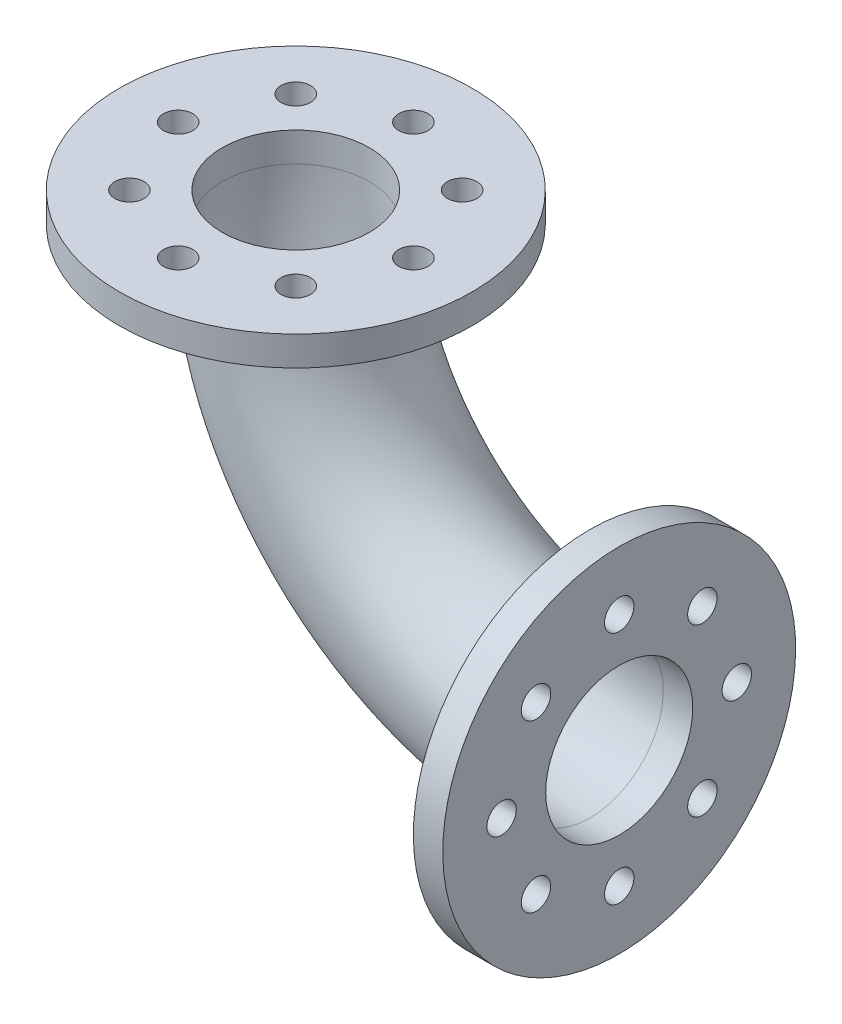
ISO-10303-21;
HEADER;
FILE_DESCRIPTION(('STEP AP214'),'2;1');
FILE_NAME('part.step','',(''),(''),'','','');
FILE_SCHEMA(('AUTOMOTIVE_DESIGN { 1 0 10303 214 1 1 1 1 }'));
ENDSEC;
DATA;
#1=APPLICATION_CONTEXT('core data for automotive mechanical design processes');
#2=APPLICATION_PROTOCOL_DEFINITION('international standard','automotive_design',2000,#1);
#3=PRODUCT_CONTEXT('',#1,'mechanical');
#4=PRODUCT('Part','Part','',(#3));
#5=PRODUCT_RELATED_PRODUCT_CATEGORY('part','',(#4));
#6=PRODUCT_DEFINITION_FORMATION('','',#4);
#7=PRODUCT_DEFINITION_CONTEXT('part definition',#1,'design');
#8=PRODUCT_DEFINITION('design','',#6,#7);
#9=PRODUCT_DEFINITION_SHAPE('','',#8);
#10=(LENGTH_UNIT() NAMED_UNIT(*) SI_UNIT(.MILLI.,.METRE.));
#11=(NAMED_UNIT(*) PLANE_ANGLE_UNIT() SI_UNIT($,.RADIAN.));
#12=(NAMED_UNIT(*) SI_UNIT($,.STERADIAN.) SOLID_ANGLE_UNIT());
#13=UNCERTAINTY_MEASURE_WITH_UNIT(LENGTH_MEASURE(1.E-05),#10,'distance_accuracy_value','');
#14=(GEOMETRIC_REPRESENTATION_CONTEXT(3) GLOBAL_UNCERTAINTY_ASSIGNED_CONTEXT((#13)) GLOBAL_UNIT_ASSIGNED_CONTEXT((#10,
#11,#12)) REPRESENTATION_CONTEXT('',''));
#15=CARTESIAN_POINT('',(0.,0.,0.));
#16=DIRECTION('',(0.,0.,1.));
#17=DIRECTION('',(1.,0.,0.));
#18=AXIS2_PLACEMENT_3D('',#15,#16,#17);
#19=CARTESIAN_POINT('',(0.,0.,0.));
#20=DIRECTION('',(0.,0.,-1.));
#21=DIRECTION('',(-1.,0.,0.));
#22=AXIS2_PLACEMENT_3D('',#19,#20,#21);
#23=TOROIDAL_SURFACE('',#22,50.,12.5);
#24=CARTESIAN_POINT('',(1.74574168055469E-13,-50.,0.));
#25=DIRECTION('',(-1.,0.,0.));
#26=DIRECTION('',(0.,0.,1.));
#27=AXIS2_PLACEMENT_3D('',#24,#25,#26);
#28=CIRCLE('',#27,12.5);
#29=CARTESIAN_POINT('',(2.18217710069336E-13,-62.5,0.));
#30=VERTEX_POINT('',#29);
#31=EDGE_CURVE('E10',#30,#30,#28,.T.);
#32=CARTESIAN_POINT('',(-50.,0.,0.));
#33=DIRECTION('',(0.,1.,0.));
#34=DIRECTION('',(0.,0.,1.));
#35=AXIS2_PLACEMENT_3D('',#32,#33,#34);
#36=CIRCLE('',#35,12.5);
#37=CARTESIAN_POINT('',(-62.5,0.,0.));
#38=VERTEX_POINT('',#37);
#39=EDGE_CURVE('E41',#38,#38,#36,.T.);
#40=CARTESIAN_POINT('',(0.,0.,0.));
#41=DIRECTION('',(0.,0.,-1.));
#42=DIRECTION('',(-1.,0.,0.));
#43=AXIS2_PLACEMENT_3D('',#40,#41,#42);
#44=CIRCLE('',#43,62.5);
#45=EDGE_CURVE('',#30,#38,#44,.T.);
#46=ORIENTED_EDGE('',*,*,#31,.F.);
#47=ORIENTED_EDGE('',*,*,#39,.T.);
#48=ORIENTED_EDGE('',*,*,#45,.T.);
#49=ORIENTED_EDGE('',*,*,#45,.F.);
#50=EDGE_LOOP('',(#46,#48,#47,#49));
#51=FACE_BOUND('',#50,.T.);
#52=ADVANCED_FACE('F30',(#51),#23,.F.);
#53=CARTESIAN_POINT('',(0.,0.,0.));
#54=DIRECTION('',(0.,0.,-1.));
#55=DIRECTION('',(-1.,0.,0.));
#56=AXIS2_PLACEMENT_3D('',#53,#54,#55);
#57=TOROIDAL_SURFACE('',#56,50.,15.);
#58=CARTESIAN_POINT('',(1.74574168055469E-13,-50.,0.));
#59=DIRECTION('',(1.,0.,0.));
#60=DIRECTION('',(0.,1.,0.));
#61=AXIS2_PLACEMENT_3D('',#58,#59,#60);
#62=CIRCLE('',#61,15.);
#63=CARTESIAN_POINT('',(2.2694641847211E-13,-65.,0.));
#64=VERTEX_POINT('',#63);
#65=EDGE_CURVE('E56',#64,#64,#62,.F.);
#66=CARTESIAN_POINT('',(-50.,0.,0.));
#67=DIRECTION('',(0.,1.,0.));
#68=DIRECTION('',(0.,0.,1.));
#69=AXIS2_PLACEMENT_3D('',#66,#67,#68);
#70=CIRCLE('',#69,15.);
#71=CARTESIAN_POINT('',(-65.,0.,0.));
#72=VERTEX_POINT('',#71);
#73=EDGE_CURVE('E37',#72,#72,#70,.T.);
#74=CARTESIAN_POINT('',(0.,0.,0.));
#75=DIRECTION('',(0.,0.,-1.));
#76=DIRECTION('',(-1.,0.,0.));
#77=AXIS2_PLACEMENT_3D('',#74,#75,#76);
#78=CIRCLE('',#77,65.);
#79=EDGE_CURVE('',#64,#72,#78,.T.);
#80=ORIENTED_EDGE('',*,*,#65,.T.);
#81=ORIENTED_EDGE('',*,*,#73,.F.);
#82=ORIENTED_EDGE('',*,*,#79,.T.);
#83=ORIENTED_EDGE('',*,*,#79,.F.);
#84=EDGE_LOOP('',(#80,#82,#81,#83));
#85=FACE_BOUND('',#84,.T.);
#86=ADVANCED_FACE('F32',(#85),#57,.T.);
#87=CARTESIAN_POINT('',(-50.,5.,0.));
#88=DIRECTION('',(0.,1.,0.));
#89=DIRECTION('',(0.,0.,1.));
#90=AXIS2_PLACEMENT_3D('',#87,#88,#89);
#91=PLANE('',#90);
#92=CARTESIAN_POINT('',(-64.1421356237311,5.,14.1421356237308));
#93=DIRECTION('',(0.,1.,0.));
#94=DIRECTION('',(0.707106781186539,0.,0.707106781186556));
#95=AXIS2_PLACEMENT_3D('',#92,#93,#94);
#96=CIRCLE('',#95,2.5);
#97=CARTESIAN_POINT('',(-62.3743686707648,5.,15.9099025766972));
#98=VERTEX_POINT('',#97);
#99=EDGE_CURVE('E113',#98,#98,#96,.T.);
#100=ORIENTED_EDGE('',*,*,#99,.F.);
#101=EDGE_LOOP('',(#100));
#102=FACE_BOUND('',#101,.T.);
#103=CARTESIAN_POINT('',(-50.0000000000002,5.,20.));
#104=DIRECTION('',(0.,1.,0.));
#105=DIRECTION('',(1.,0.,0.));
#106=AXIS2_PLACEMENT_3D('',#103,#104,#105);
#107=CIRCLE('',#106,2.5);
#108=CARTESIAN_POINT('',(-47.5000000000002,5.,20.));
#109=VERTEX_POINT('',#108);
#110=EDGE_CURVE('E107',#109,#109,#107,.T.);
#111=ORIENTED_EDGE('',*,*,#110,.F.);
#112=EDGE_LOOP('',(#111));
#113=FACE_BOUND('',#112,.T.);
#114=CARTESIAN_POINT('',(-35.8578643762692,5.,14.1421356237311));
#115=DIRECTION('',(0.,1.,0.));
#116=DIRECTION('',(0.707106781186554,0.,-0.707106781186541));
#117=AXIS2_PLACEMENT_3D('',#114,#115,#116);
#118=CIRCLE('',#117,2.5);
#119=CARTESIAN_POINT('',(-34.0900974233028,5.,12.3743686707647));
#120=VERTEX_POINT('',#119);
#121=EDGE_CURVE('E99',#120,#120,#118,.T.);
#122=ORIENTED_EDGE('',*,*,#121,.F.);
#123=EDGE_LOOP('',(#122));
#124=FACE_BOUND('',#123,.T.);
#125=CARTESIAN_POINT('',(-30.,5.,1.39659334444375E-13));
#126=DIRECTION('',(0.,1.,0.));
#127=DIRECTION('',(0.,0.,-1.));
#128=AXIS2_PLACEMENT_3D('',#125,#126,#127);
#129=CIRCLE('',#128,2.5);
#130=CARTESIAN_POINT('',(-30.,5.,-2.49999999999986));
#131=VERTEX_POINT('',#130);
#132=EDGE_CURVE('E90',#131,#131,#129,.T.);
#133=ORIENTED_EDGE('',*,*,#132,.F.);
#134=EDGE_LOOP('',(#133));
#135=FACE_BOUND('',#134,.T.);
#136=CARTESIAN_POINT('',(-35.857864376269,5.,-14.1421356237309));
#137=DIRECTION('',(0.,1.,0.));
#138=DIRECTION('',(-0.707106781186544,0.,-0.707106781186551));
#139=AXIS2_PLACEMENT_3D('',#136,#137,#138);
#140=CIRCLE('',#139,2.5);
#141=CARTESIAN_POINT('',(-37.6256313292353,5.,-15.9099025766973));
#142=VERTEX_POINT('',#141);
#143=EDGE_CURVE('E87',#142,#142,#140,.T.);
#144=ORIENTED_EDGE('',*,*,#143,.F.);
#145=EDGE_LOOP('',(#144));
#146=FACE_BOUND('',#145,.T.);
#147=CARTESIAN_POINT('',(-49.9999999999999,5.,-20.));
#148=DIRECTION('',(0.,1.,0.));
#149=DIRECTION('',(-1.,0.,0.));
#150=AXIS2_PLACEMENT_3D('',#147,#148,#149);
#151=CIRCLE('',#150,2.5);
#152=CARTESIAN_POINT('',(-52.4999999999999,5.,-20.));
#153=VERTEX_POINT('',#152);
#154=EDGE_CURVE('E83',#153,#153,#151,.T.);
#155=ORIENTED_EDGE('',*,*,#154,.F.);
#156=EDGE_LOOP('',(#155));
#157=FACE_BOUND('',#156,.T.);
#158=CARTESIAN_POINT('',(-64.1421356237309,5.,-14.142135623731));
#159=DIRECTION('',(0.,1.,0.));
#160=DIRECTION('',(-0.707106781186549,0.,0.707106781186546));
#161=AXIS2_PLACEMENT_3D('',#158,#159,#160);
#162=CIRCLE('',#161,2.5);
#163=CARTESIAN_POINT('',(-65.9099025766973,5.,-12.3743686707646));
#164=VERTEX_POINT('',#163);
#165=EDGE_CURVE('E77',#164,#164,#162,.T.);
#166=ORIENTED_EDGE('',*,*,#165,.F.);
#167=EDGE_LOOP('',(#166));
#168=FACE_BOUND('',#167,.T.);
#169=CARTESIAN_POINT('',(-70.,5.,0.));
#170=DIRECTION('',(0.,1.,0.));
#171=DIRECTION('',(0.,0.,1.));
#172=AXIS2_PLACEMENT_3D('',#169,#170,#171);
#173=CIRCLE('',#172,2.5);
#174=CARTESIAN_POINT('',(-70.,5.,2.5));
#175=VERTEX_POINT('',#174);
#176=EDGE_CURVE('E71',#175,#175,#173,.T.);
#177=ORIENTED_EDGE('',*,*,#176,.F.);
#178=EDGE_LOOP('',(#177));
#179=FACE_BOUND('',#178,.T.);
#180=CARTESIAN_POINT('',(-50.,5.,0.));
#181=DIRECTION('',(0.,1.,0.));
#182=DIRECTION('',(0.,0.,1.));
#183=AXIS2_PLACEMENT_3D('',#180,#181,#182);
#184=CIRCLE('',#183,30.);
#185=CARTESIAN_POINT('',(-50.,5.,30.));
#186=VERTEX_POINT('',#185);
#187=EDGE_CURVE('E45',#186,#186,#184,.T.);
#188=ORIENTED_EDGE('',*,*,#187,.T.);
#189=EDGE_LOOP('',(#188));
#190=FACE_BOUND('',#189,.T.);
#191=CARTESIAN_POINT('',(-50.,5.,0.));
#192=DIRECTION('',(0.,1.,0.));
#193=DIRECTION('',(0.,0.,1.));
#194=AXIS2_PLACEMENT_3D('',#191,#192,#193);
#195=CIRCLE('',#194,12.5);
#196=CARTESIAN_POINT('',(-50.,5.,12.5));
#197=VERTEX_POINT('',#196);
#198=EDGE_CURVE('E53',#197,#197,#195,.T.);
#199=ORIENTED_EDGE('',*,*,#198,.F.);
#200=EDGE_LOOP('',(#199));
#201=FACE_BOUND('',#200,.T.);
#202=ADVANCED_FACE('F209',(#102,#113,#124,#135,#146,#157,#168,#179,#190,#201),#91,.T.);
#203=CARTESIAN_POINT('',(-50.,0.,0.));
#204=DIRECTION('',(0.,1.,0.));
#205=DIRECTION('',(0.,0.,1.));
#206=AXIS2_PLACEMENT_3D('',#203,#204,#205);
#207=PLANE('',#206);
#208=CARTESIAN_POINT('',(-64.1421356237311,0.,14.1421356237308));
#209=DIRECTION('',(0.,1.,0.));
#210=DIRECTION('',(0.,0.,1.));
#211=AXIS2_PLACEMENT_3D('',#208,#209,#210);
#212=CIRCLE('',#211,2.5);
#213=CARTESIAN_POINT('',(-64.1421356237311,0.,16.6421356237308));
#214=VERTEX_POINT('',#213);
#215=EDGE_CURVE('E110',#214,#214,#212,.F.);
#216=ORIENTED_EDGE('',*,*,#215,.F.);
#217=EDGE_LOOP('',(#216));
#218=FACE_BOUND('',#217,.T.);
#219=CARTESIAN_POINT('',(-50.0000000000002,0.,20.));
#220=DIRECTION('',(0.,1.,0.));
#221=DIRECTION('',(0.,0.,1.));
#222=AXIS2_PLACEMENT_3D('',#219,#220,#221);
#223=CIRCLE('',#222,2.5);
#224=CARTESIAN_POINT('',(-50.0000000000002,0.,22.5));
#225=VERTEX_POINT('',#224);
#226=EDGE_CURVE('E102',#225,#225,#223,.F.);
#227=ORIENTED_EDGE('',*,*,#226,.F.);
#228=EDGE_LOOP('',(#227));
#229=FACE_BOUND('',#228,.T.);
#230=CARTESIAN_POINT('',(-35.8578643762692,0.,14.1421356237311));
#231=DIRECTION('',(0.,1.,0.));
#232=DIRECTION('',(0.,0.,1.));
#233=AXIS2_PLACEMENT_3D('',#230,#231,#232);
#234=CIRCLE('',#233,2.5);
#235=CARTESIAN_POINT('',(-35.8578643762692,0.,16.6421356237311));
#236=VERTEX_POINT('',#235);
#237=EDGE_CURVE('E98',#236,#236,#234,.F.);
#238=ORIENTED_EDGE('',*,*,#237,.F.);
#239=EDGE_LOOP('',(#238));
#240=FACE_BOUND('',#239,.T.);
#241=CARTESIAN_POINT('',(-30.,0.,1.39659334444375E-13));
#242=DIRECTION('',(0.,1.,0.));
#243=DIRECTION('',(0.,0.,1.));
#244=AXIS2_PLACEMENT_3D('',#241,#242,#243);
#245=CIRCLE('',#244,2.5);
#246=CARTESIAN_POINT('',(-30.,0.,2.50000000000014));
#247=VERTEX_POINT('',#246);
#248=EDGE_CURVE('E95',#247,#247,#245,.F.);
#249=ORIENTED_EDGE('',*,*,#248,.F.);
#250=EDGE_LOOP('',(#249));
#251=FACE_BOUND('',#250,.T.);
#252=CARTESIAN_POINT('',(-35.857864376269,0.,-14.1421356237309));
#253=DIRECTION('',(0.,1.,0.));
#254=DIRECTION('',(0.,0.,1.));
#255=AXIS2_PLACEMENT_3D('',#252,#253,#254);
#256=CIRCLE('',#255,2.5);
#257=CARTESIAN_POINT('',(-35.857864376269,0.,-11.6421356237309));
#258=VERTEX_POINT('',#257);
#259=EDGE_CURVE('E86',#258,#258,#256,.F.);
#260=ORIENTED_EDGE('',*,*,#259,.F.);
#261=EDGE_LOOP('',(#260));
#262=FACE_BOUND('',#261,.T.);
#263=CARTESIAN_POINT('',(-49.9999999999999,0.,-20.));
#264=DIRECTION('',(0.,1.,0.));
#265=DIRECTION('',(0.,0.,1.));
#266=AXIS2_PLACEMENT_3D('',#263,#264,#265);
#267=CIRCLE('',#266,2.5);
#268=CARTESIAN_POINT('',(-49.9999999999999,0.,-17.5));
#269=VERTEX_POINT('',#268);
#270=EDGE_CURVE('E80',#269,#269,#267,.F.);
#271=ORIENTED_EDGE('',*,*,#270,.F.);
#272=EDGE_LOOP('',(#271));
#273=FACE_BOUND('',#272,.T.);
#274=CARTESIAN_POINT('',(-64.1421356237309,0.,-14.142135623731));
#275=DIRECTION('',(0.,1.,0.));
#276=DIRECTION('',(0.,0.,1.));
#277=AXIS2_PLACEMENT_3D('',#274,#275,#276);
#278=CIRCLE('',#277,2.5);
#279=CARTESIAN_POINT('',(-64.1421356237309,0.,-11.642135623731));
#280=VERTEX_POINT('',#279);
#281=EDGE_CURVE('E74',#280,#280,#278,.F.);
#282=ORIENTED_EDGE('',*,*,#281,.F.);
#283=EDGE_LOOP('',(#282));
#284=FACE_BOUND('',#283,.T.);
#285=CARTESIAN_POINT('',(-70.,0.,0.));
#286=DIRECTION('',(0.,1.,0.));
#287=DIRECTION('',(0.,0.,1.));
#288=AXIS2_PLACEMENT_3D('',#285,#286,#287);
#289=CIRCLE('',#288,2.5);
#290=CARTESIAN_POINT('',(-70.,0.,2.5));
#291=VERTEX_POINT('',#290);
#292=EDGE_CURVE('E68',#291,#291,#289,.F.);
#293=ORIENTED_EDGE('',*,*,#292,.F.);
#294=EDGE_LOOP('',(#293));
#295=FACE_BOUND('',#294,.T.);
#296=ORIENTED_EDGE('',*,*,#73,.T.);
#297=EDGE_LOOP('',(#296));
#298=FACE_BOUND('',#297,.T.);
#299=CARTESIAN_POINT('',(-50.,0.,0.));
#300=DIRECTION('',(0.,1.,0.));
#301=DIRECTION('',(0.,0.,1.));
#302=AXIS2_PLACEMENT_3D('',#299,#300,#301);
#303=CIRCLE('',#302,30.);
#304=CARTESIAN_POINT('',(-50.,0.,30.));
#305=VERTEX_POINT('',#304);
#306=EDGE_CURVE('E50',#305,#305,#303,.T.);
#307=ORIENTED_EDGE('',*,*,#306,.F.);
#308=EDGE_LOOP('',(#307));
#309=FACE_BOUND('',#308,.T.);
#310=ADVANCED_FACE('F217',(#218,#229,#240,#251,#262,#273,#284,#295,#298,#309),#207,.F.);
#311=CARTESIAN_POINT('',(-50.,5.,0.));
#312=DIRECTION('',(0.,-1.,0.));
#313=DIRECTION('',(0.,0.,-1.));
#314=AXIS2_PLACEMENT_3D('',#311,#312,#313);
#315=CYLINDRICAL_SURFACE('',#314,30.);
#316=ORIENTED_EDGE('',*,*,#187,.F.);
#317=EDGE_LOOP('',(#316));
#318=FACE_BOUND('',#317,.T.);
#319=ORIENTED_EDGE('',*,*,#306,.T.);
#320=EDGE_LOOP('',(#319));
#321=FACE_BOUND('',#320,.T.);
#322=ADVANCED_FACE('F213',(#318,#321),#315,.T.);
#323=CARTESIAN_POINT('',(-50.,5.,0.));
#324=DIRECTION('',(0.,-1.,0.));
#325=DIRECTION('',(0.,0.,-1.));
#326=AXIS2_PLACEMENT_3D('',#323,#324,#325);
#327=CYLINDRICAL_SURFACE('',#326,12.5);
#328=ORIENTED_EDGE('',*,*,#198,.T.);
#329=EDGE_LOOP('',(#328));
#330=FACE_BOUND('',#329,.T.);
#331=ORIENTED_EDGE('',*,*,#39,.F.);
#332=EDGE_LOOP('',(#331));
#333=FACE_BOUND('',#332,.T.);
#334=ADVANCED_FACE('F216',(#330,#333),#327,.F.);
#335=CARTESIAN_POINT('',(4.99999999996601,-50.0000000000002,0.));
#336=DIRECTION('',(1.,0.,0.));
#337=DIRECTION('',(0.,1.,0.));
#338=AXIS2_PLACEMENT_3D('',#335,#336,#337);
#339=PLANE('',#338);
#340=CARTESIAN_POINT('',(4.99999999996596,-35.857864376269,14.1421356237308));
#341=DIRECTION('',(1.,0.,0.));
#342=DIRECTION('',(0.,1.,0.));
#343=AXIS2_PLACEMENT_3D('',#340,#341,#342);
#344=CIRCLE('',#343,2.5);
#345=CARTESIAN_POINT('',(4.99999999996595,-33.357864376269,14.1421356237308));
#346=VERTEX_POINT('',#345);
#347=EDGE_CURVE('E159',#346,#346,#344,.F.);
#348=ORIENTED_EDGE('',*,*,#347,.T.);
#349=EDGE_LOOP('',(#348));
#350=FACE_BOUND('',#349,.T.);
#351=CARTESIAN_POINT('',(4.99999999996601,-50.,20.));
#352=DIRECTION('',(1.,0.,0.));
#353=DIRECTION('',(0.,1.,0.));
#354=AXIS2_PLACEMENT_3D('',#351,#352,#353);
#355=CIRCLE('',#354,2.5);
#356=CARTESIAN_POINT('',(4.999999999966,-47.5,20.));
#357=VERTEX_POINT('',#356);
#358=EDGE_CURVE('E153',#357,#357,#355,.F.);
#359=ORIENTED_EDGE('',*,*,#358,.T.);
#360=EDGE_LOOP('',(#359));
#361=FACE_BOUND('',#360,.T.);
#362=CARTESIAN_POINT('',(4.99999999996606,-64.142135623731,14.1421356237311));
#363=DIRECTION('',(1.,0.,0.));
#364=DIRECTION('',(0.,1.,0.));
#365=AXIS2_PLACEMENT_3D('',#362,#363,#364);
#366=CIRCLE('',#365,2.5);
#367=CARTESIAN_POINT('',(4.99999999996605,-61.642135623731,14.1421356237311));
#368=VERTEX_POINT('',#367);
#369=EDGE_CURVE('E147',#368,#368,#366,.F.);
#370=ORIENTED_EDGE('',*,*,#369,.T.);
#371=EDGE_LOOP('',(#370));
#372=FACE_BOUND('',#371,.T.);
#373=CARTESIAN_POINT('',(4.99999999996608,-70.0000000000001,1.39659334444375E-13));
#374=DIRECTION('',(1.,0.,0.));
#375=DIRECTION('',(0.,1.,0.));
#376=AXIS2_PLACEMENT_3D('',#373,#374,#375);
#377=CIRCLE('',#376,2.5);
#378=CARTESIAN_POINT('',(4.99999999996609,-72.5000000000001,1.39659334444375E-13));
#379=VERTEX_POINT('',#378);
#380=EDGE_CURVE('E141',#379,#379,#377,.F.);
#381=ORIENTED_EDGE('',*,*,#380,.T.);
#382=EDGE_LOOP('',(#381));
#383=FACE_BOUND('',#382,.T.);
#384=CARTESIAN_POINT('',(4.99999999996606,-64.1421356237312,-14.1421356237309));
#385=DIRECTION('',(1.,0.,0.));
#386=DIRECTION('',(0.,1.,0.));
#387=AXIS2_PLACEMENT_3D('',#384,#385,#386);
#388=CIRCLE('',#387,2.5);
#389=CARTESIAN_POINT('',(4.99999999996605,-61.6421356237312,-14.1421356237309));
#390=VERTEX_POINT('',#389);
#391=EDGE_CURVE('E135',#390,#390,#388,.F.);
#392=ORIENTED_EDGE('',*,*,#391,.T.);
#393=EDGE_LOOP('',(#392));
#394=FACE_BOUND('',#393,.T.);
#395=CARTESIAN_POINT('',(4.99999999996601,-50.0000000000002,-20.));
#396=DIRECTION('',(1.,0.,0.));
#397=DIRECTION('',(0.,1.,0.));
#398=AXIS2_PLACEMENT_3D('',#395,#396,#397);
#399=CIRCLE('',#398,2.5);
#400=CARTESIAN_POINT('',(4.999999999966,-47.5000000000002,-20.));
#401=VERTEX_POINT('',#400);
#402=EDGE_CURVE('E129',#401,#401,#399,.F.);
#403=ORIENTED_EDGE('',*,*,#402,.T.);
#404=EDGE_LOOP('',(#403));
#405=FACE_BOUND('',#404,.T.);
#406=CARTESIAN_POINT('',(4.99999999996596,-35.8578643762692,-14.142135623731));
#407=DIRECTION('',(1.,0.,0.));
#408=DIRECTION('',(0.,1.,0.));
#409=AXIS2_PLACEMENT_3D('',#406,#407,#408);
#410=CIRCLE('',#409,2.5);
#411=CARTESIAN_POINT('',(4.99999999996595,-33.3578643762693,-14.142135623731));
#412=VERTEX_POINT('',#411);
#413=EDGE_CURVE('E123',#412,#412,#410,.F.);
#414=ORIENTED_EDGE('',*,*,#413,.T.);
#415=EDGE_LOOP('',(#414));
#416=FACE_BOUND('',#415,.T.);
#417=CARTESIAN_POINT('',(4.99999999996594,-30.0000000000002,0.));
#418=DIRECTION('',(1.,0.,0.));
#419=DIRECTION('',(0.,1.,0.));
#420=AXIS2_PLACEMENT_3D('',#417,#418,#419);
#421=CIRCLE('',#420,2.5);
#422=CARTESIAN_POINT('',(4.99999999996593,-27.5000000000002,0.));
#423=VERTEX_POINT('',#422);
#424=EDGE_CURVE('E117',#423,#423,#421,.F.);
#425=ORIENTED_EDGE('',*,*,#424,.T.);
#426=EDGE_LOOP('',(#425));
#427=FACE_BOUND('',#426,.T.);
#428=CARTESIAN_POINT('',(4.99999999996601,-50.0000000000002,0.));
#429=DIRECTION('',(1.,0.,0.));
#430=DIRECTION('',(0.,1.,0.));
#431=AXIS2_PLACEMENT_3D('',#428,#429,#430);
#432=CIRCLE('',#431,30.);
#433=CARTESIAN_POINT('',(4.9999999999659,-20.0000000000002,0.));
#434=VERTEX_POINT('',#433);
#435=EDGE_CURVE('E59',#434,#434,#432,.T.);
#436=ORIENTED_EDGE('',*,*,#435,.T.);
#437=EDGE_LOOP('',(#436));
#438=FACE_BOUND('',#437,.T.);
#439=CARTESIAN_POINT('',(4.99999999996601,-50.0000000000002,0.));
#440=DIRECTION('',(1.,0.,0.));
#441=DIRECTION('',(0.,1.,0.));
#442=AXIS2_PLACEMENT_3D('',#439,#440,#441);
#443=CIRCLE('',#442,12.5);
#444=CARTESIAN_POINT('',(4.99999999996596,-37.5000000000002,0.));
#445=VERTEX_POINT('',#444);
#446=EDGE_CURVE('E65',#445,#445,#443,.T.);
#447=ORIENTED_EDGE('',*,*,#446,.F.);
#448=EDGE_LOOP('',(#447));
#449=FACE_BOUND('',#448,.T.);
#450=ADVANCED_FACE('F171',(#350,#361,#372,#383,#394,#405,#416,#427,#438,#449),#339,.T.);
#451=CARTESIAN_POINT('',(-3.39925394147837E-11,-50.0000000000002,0.));
#452=DIRECTION('',(1.,0.,0.));
#453=DIRECTION('',(0.,1.,0.));
#454=AXIS2_PLACEMENT_3D('',#451,#452,#453);
#455=PLANE('',#454);
#456=CARTESIAN_POINT('',(1.70784034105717E-10,-35.8578643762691,14.1421356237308));
#457=DIRECTION('',(-1.,0.,0.));
#458=DIRECTION('',(0.,-0.707106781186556,-0.707106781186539));
#459=AXIS2_PLACEMENT_3D('',#456,#457,#458);
#460=CIRCLE('',#459,2.5);
#461=CARTESIAN_POINT('',(1.70789714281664E-10,-37.6256313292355,12.3743686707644));
#462=VERTEX_POINT('',#461);
#463=EDGE_CURVE('E156',#462,#462,#460,.T.);
#464=ORIENTED_EDGE('',*,*,#463,.F.);
#465=EDGE_LOOP('',(#464));
#466=FACE_BOUND('',#465,.T.);
#467=CARTESIAN_POINT('',(1.70843167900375E-10,-50.,20.));
#468=DIRECTION('',(-1.,0.,0.));
#469=DIRECTION('',(0.,0.,-1.));
#470=AXIS2_PLACEMENT_3D('',#467,#468,#469);
#471=CIRCLE('',#470,2.5);
#472=CARTESIAN_POINT('',(1.70841488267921E-10,-50.,17.5));
#473=VERTEX_POINT('',#472);
#474=EDGE_CURVE('E150',#473,#473,#471,.T.);
#475=ORIENTED_EDGE('',*,*,#474,.F.);
#476=EDGE_LOOP('',(#475));
#477=FACE_BOUND('',#476,.T.);
#478=CARTESIAN_POINT('',(1.70902301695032E-10,-64.142135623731,14.1421356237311));
#479=DIRECTION('',(-1.,0.,0.));
#480=DIRECTION('',(0.,0.707106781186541,-0.707106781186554));
#481=AXIS2_PLACEMENT_3D('',#478,#479,#480);
#482=CIRCLE('',#481,2.5);
#483=CARTESIAN_POINT('',(1.70893262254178E-10,-62.3743686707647,12.3743686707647));
#484=VERTEX_POINT('',#483);
#485=EDGE_CURVE('E144',#484,#484,#482,.T.);
#486=ORIENTED_EDGE('',*,*,#485,.F.);
#487=EDGE_LOOP('',(#486));
#488=FACE_BOUND('',#487,.T.);
#489=CARTESIAN_POINT('',(1.70926434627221E-10,-70.0000000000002,1.39659334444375E-13));
#490=DIRECTION('',(-1.,0.,0.));
#491=DIRECTION('',(0.,1.,0.));
#492=AXIS2_PLACEMENT_3D('',#489,#490,#491);
#493=CIRCLE('',#492,2.5);
#494=CARTESIAN_POINT('',(1.70937916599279E-10,-72.5000000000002,1.39659334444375E-13));
#495=VERTEX_POINT('',#494);
#496=EDGE_CURVE('E138',#495,#495,#493,.T.);
#497=ORIENTED_EDGE('',*,*,#496,.F.);
#498=EDGE_LOOP('',(#497));
#499=FACE_BOUND('',#498,.T.);
#500=CARTESIAN_POINT('',(1.70902301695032E-10,-64.1421356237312,-14.1421356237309));
#501=DIRECTION('',(-1.,0.,0.));
#502=DIRECTION('',(0.,0.707106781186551,0.707106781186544));
#503=AXIS2_PLACEMENT_3D('',#500,#501,#502);
#504=CIRCLE('',#503,2.5);
#505=CARTESIAN_POINT('',(1.70893262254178E-10,-62.3743686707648,-12.3743686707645));
#506=VERTEX_POINT('',#505);
#507=EDGE_CURVE('E132',#506,#506,#504,.T.);
#508=ORIENTED_EDGE('',*,*,#507,.F.);
#509=EDGE_LOOP('',(#508));
#510=FACE_BOUND('',#509,.T.);
#511=CARTESIAN_POINT('',(1.70843167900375E-10,-50.0000000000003,-20.));
#512=DIRECTION('',(-1.,0.,0.));
#513=DIRECTION('',(0.,0.,1.));
#514=AXIS2_PLACEMENT_3D('',#511,#512,#513);
#515=CIRCLE('',#514,2.5);
#516=CARTESIAN_POINT('',(1.70841488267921E-10,-50.0000000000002,-17.5));
#517=VERTEX_POINT('',#516);
#518=EDGE_CURVE('E126',#517,#517,#515,.T.);
#519=ORIENTED_EDGE('',*,*,#518,.F.);
#520=EDGE_LOOP('',(#519));
#521=FACE_BOUND('',#520,.T.);
#522=CARTESIAN_POINT('',(1.70784034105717E-10,-35.8578643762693,-14.142135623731));
#523=DIRECTION('',(-1.,0.,0.));
#524=DIRECTION('',(0.,-0.707106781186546,0.707106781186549));
#525=AXIS2_PLACEMENT_3D('',#522,#523,#524);
#526=CIRCLE('',#525,2.5);
#527=CARTESIAN_POINT('',(1.70789714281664E-10,-37.6256313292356,-12.3743686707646));
#528=VERTEX_POINT('',#527);
#529=EDGE_CURVE('E120',#528,#528,#526,.T.);
#530=ORIENTED_EDGE('',*,*,#529,.F.);
#531=EDGE_LOOP('',(#530));
#532=FACE_BOUND('',#531,.T.);
#533=CARTESIAN_POINT('',(1.70759901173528E-10,-30.0000000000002,0.));
#534=DIRECTION('',(-1.,0.,0.));
#535=DIRECTION('',(0.,-1.,0.));
#536=AXIS2_PLACEMENT_3D('',#533,#534,#535);
#537=CIRCLE('',#536,2.5);
#538=CARTESIAN_POINT('',(1.7076862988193E-10,-32.5000000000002,0.));
#539=VERTEX_POINT('',#538);
#540=EDGE_CURVE('E116',#539,#539,#537,.T.);
#541=ORIENTED_EDGE('',*,*,#540,.F.);
#542=EDGE_LOOP('',(#541));
#543=FACE_BOUND('',#542,.T.);
#544=ORIENTED_EDGE('',*,*,#65,.F.);
#545=EDGE_LOOP('',(#544));
#546=FACE_BOUND('',#545,.T.);
#547=CARTESIAN_POINT('',(-3.39925394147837E-11,-50.0000000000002,0.));
#548=DIRECTION('',(1.,0.,0.));
#549=DIRECTION('',(0.,1.,0.));
#550=AXIS2_PLACEMENT_3D('',#547,#548,#549);
#551=CIRCLE('',#550,30.);
#552=CARTESIAN_POINT('',(-3.4097283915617E-11,-20.0000000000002,0.));
#553=VERTEX_POINT('',#552);
#554=EDGE_CURVE('E62',#553,#553,#551,.T.);
#555=ORIENTED_EDGE('',*,*,#554,.F.);
#556=EDGE_LOOP('',(#555));
#557=FACE_BOUND('',#556,.T.);
#558=ADVANCED_FACE('F167',(#466,#477,#488,#499,#510,#521,#532,#543,#546,#557),#455,.F.);
#559=CARTESIAN_POINT('',(4.99999999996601,-50.0000000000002,0.));
#560=DIRECTION('',(-1.,0.,0.));
#561=DIRECTION('',(0.,-1.,0.));
#562=AXIS2_PLACEMENT_3D('',#559,#560,#561);
#563=CYLINDRICAL_SURFACE('',#562,30.);
#564=ORIENTED_EDGE('',*,*,#435,.F.);
#565=EDGE_LOOP('',(#564));
#566=FACE_BOUND('',#565,.T.);
#567=ORIENTED_EDGE('',*,*,#554,.T.);
#568=EDGE_LOOP('',(#567));
#569=FACE_BOUND('',#568,.T.);
#570=ADVANCED_FACE('F170',(#566,#569),#563,.T.);
#571=CARTESIAN_POINT('',(4.99999999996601,-50.0000000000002,0.));
#572=DIRECTION('',(-1.,0.,0.));
#573=DIRECTION('',(0.,-1.,0.));
#574=AXIS2_PLACEMENT_3D('',#571,#572,#573);
#575=CYLINDRICAL_SURFACE('',#574,12.5);
#576=ORIENTED_EDGE('',*,*,#446,.T.);
#577=EDGE_LOOP('',(#576));
#578=FACE_BOUND('',#577,.T.);
#579=ORIENTED_EDGE('',*,*,#31,.T.);
#580=EDGE_LOOP('',(#579));
#581=FACE_BOUND('',#580,.T.);
#582=ADVANCED_FACE('F192',(#578,#581),#575,.F.);
#583=CARTESIAN_POINT('',(-70.,-80.0010000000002,0.));
#584=DIRECTION('',(0.,1.,0.));
#585=DIRECTION('',(0.,0.,1.));
#586=AXIS2_PLACEMENT_3D('',#583,#584,#585);
#587=CYLINDRICAL_SURFACE('',#586,2.5);
#588=ORIENTED_EDGE('',*,*,#176,.T.);
#589=EDGE_LOOP('',(#588));
#590=FACE_BOUND('',#589,.T.);
#591=ORIENTED_EDGE('',*,*,#292,.T.);
#592=EDGE_LOOP('',(#591));
#593=FACE_BOUND('',#592,.T.);
#594=ADVANCED_FACE('F198',(#590,#593),#587,.F.);
#595=CARTESIAN_POINT('',(-64.1421356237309,-80.0010000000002,-14.142135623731));
#596=DIRECTION('',(0.,1.,0.));
#597=DIRECTION('',(0.,0.,1.));
#598=AXIS2_PLACEMENT_3D('',#595,#596,#597);
#599=CYLINDRICAL_SURFACE('',#598,2.5);
#600=ORIENTED_EDGE('',*,*,#165,.T.);
#601=EDGE_LOOP('',(#600));
#602=FACE_BOUND('',#601,.T.);
#603=ORIENTED_EDGE('',*,*,#281,.T.);
#604=EDGE_LOOP('',(#603));
#605=FACE_BOUND('',#604,.T.);
#606=ADVANCED_FACE('F240',(#602,#605),#599,.F.);
#607=CARTESIAN_POINT('',(-49.9999999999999,-80.0010000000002,-20.));
#608=DIRECTION('',(0.,1.,0.));
#609=DIRECTION('',(0.,0.,1.));
#610=AXIS2_PLACEMENT_3D('',#607,#608,#609);
#611=CYLINDRICAL_SURFACE('',#610,2.5);
#612=ORIENTED_EDGE('',*,*,#154,.T.);
#613=EDGE_LOOP('',(#612));
#614=FACE_BOUND('',#613,.T.);
#615=ORIENTED_EDGE('',*,*,#270,.T.);
#616=EDGE_LOOP('',(#615));
#617=FACE_BOUND('',#616,.T.);
#618=ADVANCED_FACE('F244',(#614,#617),#611,.F.);
#619=CARTESIAN_POINT('',(-35.857864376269,-80.0010000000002,-14.1421356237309));
#620=DIRECTION('',(0.,1.,0.));
#621=DIRECTION('',(0.,0.,1.));
#622=AXIS2_PLACEMENT_3D('',#619,#620,#621);
#623=CYLINDRICAL_SURFACE('',#622,2.5);
#624=ORIENTED_EDGE('',*,*,#143,.T.);
#625=EDGE_LOOP('',(#624));
#626=FACE_BOUND('',#625,.T.);
#627=ORIENTED_EDGE('',*,*,#259,.T.);
#628=EDGE_LOOP('',(#627));
#629=FACE_BOUND('',#628,.T.);
#630=ADVANCED_FACE('F248',(#626,#629),#623,.F.);
#631=CARTESIAN_POINT('',(-30.,-80.0010000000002,1.39659334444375E-13));
#632=DIRECTION('',(0.,1.,0.));
#633=DIRECTION('',(0.,0.,1.));
#634=AXIS2_PLACEMENT_3D('',#631,#632,#633);
#635=CYLINDRICAL_SURFACE('',#634,2.5);
#636=ORIENTED_EDGE('',*,*,#132,.T.);
#637=EDGE_LOOP('',(#636));
#638=FACE_BOUND('',#637,.T.);
#639=ORIENTED_EDGE('',*,*,#248,.T.);
#640=EDGE_LOOP('',(#639));
#641=FACE_BOUND('',#640,.T.);
#642=ADVANCED_FACE('F252',(#638,#641),#635,.F.);
#643=CARTESIAN_POINT('',(-35.8578643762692,-80.0010000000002,14.1421356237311));
#644=DIRECTION('',(0.,1.,0.));
#645=DIRECTION('',(0.,0.,1.));
#646=AXIS2_PLACEMENT_3D('',#643,#644,#645);
#647=CYLINDRICAL_SURFACE('',#646,2.5);
#648=ORIENTED_EDGE('',*,*,#121,.T.);
#649=EDGE_LOOP('',(#648));
#650=FACE_BOUND('',#649,.T.);
#651=ORIENTED_EDGE('',*,*,#237,.T.);
#652=EDGE_LOOP('',(#651));
#653=FACE_BOUND('',#652,.T.);
#654=ADVANCED_FACE('F256',(#650,#653),#647,.F.);
#655=CARTESIAN_POINT('',(-50.0000000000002,-80.0010000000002,20.));
#656=DIRECTION('',(0.,1.,0.));
#657=DIRECTION('',(0.,0.,1.));
#658=AXIS2_PLACEMENT_3D('',#655,#656,#657);
#659=CYLINDRICAL_SURFACE('',#658,2.5);
#660=ORIENTED_EDGE('',*,*,#110,.T.);
#661=EDGE_LOOP('',(#660));
#662=FACE_BOUND('',#661,.T.);
#663=ORIENTED_EDGE('',*,*,#226,.T.);
#664=EDGE_LOOP('',(#663));
#665=FACE_BOUND('',#664,.T.);
#666=ADVANCED_FACE('F260',(#662,#665),#659,.F.);
#667=CARTESIAN_POINT('',(-64.1421356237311,-80.0010000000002,14.1421356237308));
#668=DIRECTION('',(0.,1.,0.));
#669=DIRECTION('',(0.,0.,1.));
#670=AXIS2_PLACEMENT_3D('',#667,#668,#669);
#671=CYLINDRICAL_SURFACE('',#670,2.5);
#672=ORIENTED_EDGE('',*,*,#99,.T.);
#673=EDGE_LOOP('',(#672));
#674=FACE_BOUND('',#673,.T.);
#675=ORIENTED_EDGE('',*,*,#215,.T.);
#676=EDGE_LOOP('',(#675));
#677=FACE_BOUND('',#676,.T.);
#678=ADVANCED_FACE('F264',(#674,#677),#671,.F.);
#679=CARTESIAN_POINT('',(5.00099999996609,-30.0000000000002,0.));
#680=DIRECTION('',(-1.,0.,0.));
#681=DIRECTION('',(0.,-1.,0.));
#682=AXIS2_PLACEMENT_3D('',#679,#680,#681);
#683=CYLINDRICAL_SURFACE('',#682,2.5);
#684=ORIENTED_EDGE('',*,*,#424,.F.);
#685=EDGE_LOOP('',(#684));
#686=FACE_BOUND('',#685,.T.);
#687=ORIENTED_EDGE('',*,*,#540,.T.);
#688=EDGE_LOOP('',(#687));
#689=FACE_BOUND('',#688,.T.);
#690=ADVANCED_FACE('F268',(#686,#689),#683,.F.);
#691=CARTESIAN_POINT('',(5.00099999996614,-35.8578643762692,-14.142135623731));
#692=DIRECTION('',(-1.,0.,0.));
#693=DIRECTION('',(0.,-1.,0.));
#694=AXIS2_PLACEMENT_3D('',#691,#692,#693);
#695=CYLINDRICAL_SURFACE('',#694,2.5);
#696=ORIENTED_EDGE('',*,*,#413,.F.);
#697=EDGE_LOOP('',(#696));
#698=FACE_BOUND('',#697,.T.);
#699=ORIENTED_EDGE('',*,*,#529,.T.);
#700=EDGE_LOOP('',(#699));
#701=FACE_BOUND('',#700,.T.);
#702=ADVANCED_FACE('F272',(#698,#701),#695,.F.);
#703=CARTESIAN_POINT('',(5.00099999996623,-50.0000000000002,-20.));
#704=DIRECTION('',(-1.,0.,0.));
#705=DIRECTION('',(0.,-1.,0.));
#706=AXIS2_PLACEMENT_3D('',#703,#704,#705);
#707=CYLINDRICAL_SURFACE('',#706,2.5);
#708=ORIENTED_EDGE('',*,*,#402,.F.);
#709=EDGE_LOOP('',(#708));
#710=FACE_BOUND('',#709,.T.);
#711=ORIENTED_EDGE('',*,*,#518,.T.);
#712=EDGE_LOOP('',(#711));
#713=FACE_BOUND('',#712,.T.);
#714=ADVANCED_FACE('F276',(#710,#713),#707,.F.);
#715=CARTESIAN_POINT('',(5.00099999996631,-64.1421356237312,-14.1421356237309));
#716=DIRECTION('',(-1.,0.,0.));
#717=DIRECTION('',(0.,-1.,0.));
#718=AXIS2_PLACEMENT_3D('',#715,#716,#717);
#719=CYLINDRICAL_SURFACE('',#718,2.5);
#720=ORIENTED_EDGE('',*,*,#391,.F.);
#721=EDGE_LOOP('',(#720));
#722=FACE_BOUND('',#721,.T.);
#723=ORIENTED_EDGE('',*,*,#507,.T.);
#724=EDGE_LOOP('',(#723));
#725=FACE_BOUND('',#724,.T.);
#726=ADVANCED_FACE('F280',(#722,#725),#719,.F.);
#727=CARTESIAN_POINT('',(5.00099999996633,-70.0000000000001,1.39659334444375E-13));
#728=DIRECTION('',(-1.,0.,0.));
#729=DIRECTION('',(0.,-1.,0.));
#730=AXIS2_PLACEMENT_3D('',#727,#728,#729);
#731=CYLINDRICAL_SURFACE('',#730,2.5);
#732=CARTESIAN_POINT('',(4.99999999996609,-72.5000000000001,1.39659334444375E-13));
#733=CARTESIAN_POINT('',(4.94791666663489,-72.5000000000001,1.39659334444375E-13));
#734=CARTESIAN_POINT('',(4.89583333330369,-72.5000000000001,1.39659334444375E-13));
#735=CARTESIAN_POINT('',(4.79166666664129,-72.5000000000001,1.39659334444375E-13));
#736=CARTESIAN_POINT('',(4.73958333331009,-72.5000000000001,1.39659334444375E-13));
#737=CARTESIAN_POINT('',(4.63541666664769,-72.5000000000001,1.39659334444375E-13));
#738=CARTESIAN_POINT('',(4.58333333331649,-72.5000000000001,1.39659334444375E-13));
#739=CARTESIAN_POINT('',(4.47916666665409,-72.5000000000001,1.39659334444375E-13));
#740=CARTESIAN_POINT('',(4.42708333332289,-72.5000000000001,1.39659334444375E-13));
#741=CARTESIAN_POINT('',(4.32291666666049,-72.5000000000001,1.39659334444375E-13));
#742=CARTESIAN_POINT('',(4.27083333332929,-72.5000000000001,1.39659334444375E-13));
#743=CARTESIAN_POINT('',(4.1666666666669,-72.5000000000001,1.39659334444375E-13));
#744=CARTESIAN_POINT('',(4.1145833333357,-72.5000000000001,1.39659334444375E-13));
#745=CARTESIAN_POINT('',(4.0104166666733,-72.5000000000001,1.39659334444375E-13));
#746=CARTESIAN_POINT('',(3.9583333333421,-72.5000000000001,1.39659334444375E-13));
#747=CARTESIAN_POINT('',(3.8541666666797,-72.5000000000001,1.39659334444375E-13));
#748=CARTESIAN_POINT('',(3.8020833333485,-72.5000000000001,1.39659334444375E-13));
#749=CARTESIAN_POINT('',(3.6979166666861,-72.5000000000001,1.39659334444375E-13));
#750=CARTESIAN_POINT('',(3.6458333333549,-72.5000000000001,1.39659334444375E-13));
#751=CARTESIAN_POINT('',(3.5416666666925,-72.5000000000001,1.39659334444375E-13));
#752=CARTESIAN_POINT('',(3.4895833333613,-72.5000000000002,1.39659334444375E-13));
#753=CARTESIAN_POINT('',(3.3854166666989,-72.5000000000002,1.39659334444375E-13));
#754=CARTESIAN_POINT('',(3.3333333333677,-72.5000000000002,1.39659334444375E-13));
#755=CARTESIAN_POINT('',(3.2291666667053,-72.5000000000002,1.39659334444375E-13));
#756=CARTESIAN_POINT('',(3.17708333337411,-72.5000000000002,1.39659334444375E-13));
#757=CARTESIAN_POINT('',(3.07291666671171,-72.5000000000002,1.39659334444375E-13));
#758=CARTESIAN_POINT('',(3.02083333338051,-72.5000000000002,1.39659334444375E-13));
#759=CARTESIAN_POINT('',(2.91666666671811,-72.5000000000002,1.39659334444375E-13));
#760=CARTESIAN_POINT('',(2.86458333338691,-72.5000000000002,1.39659334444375E-13));
#761=CARTESIAN_POINT('',(2.76041666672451,-72.5000000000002,1.39659334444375E-13));
#762=CARTESIAN_POINT('',(2.70833333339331,-72.5000000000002,1.39659334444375E-13));
#763=CARTESIAN_POINT('',(2.60416666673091,-72.5000000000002,1.39659334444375E-13));
#764=CARTESIAN_POINT('',(2.55208333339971,-72.5000000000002,1.39659334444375E-13));
#765=CARTESIAN_POINT('',(2.44791666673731,-72.5000000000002,1.39659334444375E-13));
#766=CARTESIAN_POINT('',(2.39583333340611,-72.5000000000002,1.39659334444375E-13));
#767=CARTESIAN_POINT('',(2.29166666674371,-72.5000000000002,1.39659334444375E-13));
#768=CARTESIAN_POINT('',(2.23958333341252,-72.5000000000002,1.39659334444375E-13));
#769=CARTESIAN_POINT('',(2.13541666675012,-72.5000000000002,1.39659334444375E-13));
#770=CARTESIAN_POINT('',(2.08333333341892,-72.5000000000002,1.39659334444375E-13));
#771=CARTESIAN_POINT('',(1.97916666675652,-72.5000000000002,1.39659334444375E-13));
#772=CARTESIAN_POINT('',(1.92708333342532,-72.5000000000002,1.39659334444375E-13));
#773=CARTESIAN_POINT('',(1.82291666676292,-72.5000000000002,1.39659334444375E-13));
#774=CARTESIAN_POINT('',(1.77083333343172,-72.5000000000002,1.39659334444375E-13));
#775=CARTESIAN_POINT('',(1.66666666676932,-72.5000000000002,1.39659334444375E-13));
#776=CARTESIAN_POINT('',(1.61458333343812,-72.5000000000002,1.39659334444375E-13));
#777=CARTESIAN_POINT('',(1.51041666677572,-72.5000000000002,1.39659334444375E-13));
#778=CARTESIAN_POINT('',(1.45833333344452,-72.5000000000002,1.39659334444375E-13));
#779=CARTESIAN_POINT('',(1.35416666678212,-72.5000000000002,1.39659334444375E-13));
#780=CARTESIAN_POINT('',(1.30208333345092,-72.5000000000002,1.39659334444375E-13));
#781=CARTESIAN_POINT('',(1.19791666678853,-72.5000000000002,1.39659334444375E-13));
#782=CARTESIAN_POINT('',(1.14583333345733,-72.5000000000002,1.39659334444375E-13));
#783=CARTESIAN_POINT('',(1.04166666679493,-72.5000000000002,1.39659334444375E-13));
#784=CARTESIAN_POINT('',(0.989583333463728,-72.5000000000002,1.39659334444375E-13));
#785=CARTESIAN_POINT('',(0.885416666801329,-72.5000000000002,1.39659334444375E-13));
#786=CARTESIAN_POINT('',(0.83333333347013,-72.5000000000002,1.39659334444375E-13));
#787=CARTESIAN_POINT('',(0.729166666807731,-72.5000000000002,1.39659334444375E-13));
#788=CARTESIAN_POINT('',(0.677083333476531,-72.5000000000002,1.39659334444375E-13));
#789=CARTESIAN_POINT('',(0.572916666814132,-72.5000000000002,1.39659334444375E-13));
#790=CARTESIAN_POINT('',(0.520833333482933,-72.5000000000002,1.39659334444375E-13));
#791=CARTESIAN_POINT('',(0.416666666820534,-72.5000000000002,1.39659334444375E-13));
#792=CARTESIAN_POINT('',(0.364583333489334,-72.5000000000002,1.39659334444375E-13));
#793=CARTESIAN_POINT('',(0.260416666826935,-72.5000000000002,1.39659334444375E-13));
#794=CARTESIAN_POINT('',(0.208333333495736,-72.5000000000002,1.39659334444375E-13));
#795=CARTESIAN_POINT('',(0.104166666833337,-72.5000000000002,1.39659334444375E-13));
#796=CARTESIAN_POINT('',(0.0520833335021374,-72.5000000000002,1.39659334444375E-13));
#797=CARTESIAN_POINT('',(1.70937916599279E-10,-72.5000000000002,1.39659334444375E-13));
#798=B_SPLINE_CURVE_WITH_KNOTS('',3,(#732,#733,#734,#735,#736,#737,#738,#739,#740,#741,#742,
#743,#744,#745,#746,#747,#748,#749,#750,#751,#752,#753,#754,#755,#756,#757,#758,#759,#760,#761,
#762,#763,#764,#765,#766,#767,#768,#769,#770,#771,#772,#773,#774,#775,#776,#777,#778,#779,#780,
#781,#782,#783,#784,#785,#786,#787,#788,#789,#790,#791,#792,#793,#794,#795,#796,#797),
.UNSPECIFIED.,.F.,.F.,(4,2,2,2,2,2,2,2,2,2,2,2,2,2,2,2,2,2,2,2,2,2,2,2,2,2,2,2,2,2,2,2,4),(0.,
0.156249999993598,0.312499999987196,0.468749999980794,0.624999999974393,0.781249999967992,
0.93749999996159,1.09374999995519,1.24999999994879,1.40624999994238,1.56249999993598,
1.71874999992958,1.87499999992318,2.03124999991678,2.18749999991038,2.34374999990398,
2.49999999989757,2.65624999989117,2.81249999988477,2.96874999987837,3.12499999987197,
3.28124999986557,3.43749999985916,3.59374999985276,3.74999999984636,3.90624999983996,
4.06249999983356,4.21874999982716,4.37499999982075,4.53124999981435,4.68749999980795,
4.84374999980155,4.99999999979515),.UNSPECIFIED.);
#799=EDGE_CURVE('BSEAM284',#379,#495,#798,.T.);
#800=ORIENTED_EDGE('',*,*,#380,.F.);
#801=ORIENTED_EDGE('',*,*,#496,.T.);
#802=ORIENTED_EDGE('',*,*,#799,.T.);
#803=ORIENTED_EDGE('',*,*,#799,.F.);
#804=EDGE_LOOP('',(#800,#802,#801,#803));
#805=FACE_BOUND('',#804,.T.);
#806=ADVANCED_FACE('F284',(#805),#731,.F.);
#807=CARTESIAN_POINT('',(5.0009999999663,-64.142135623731,14.1421356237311));
#808=DIRECTION('',(-1.,0.,0.));
#809=DIRECTION('',(0.,-1.,0.));
#810=AXIS2_PLACEMENT_3D('',#807,#808,#809);
#811=CYLINDRICAL_SURFACE('',#810,2.5);
#812=ORIENTED_EDGE('',*,*,#369,.F.);
#813=EDGE_LOOP('',(#812));
#814=FACE_BOUND('',#813,.T.);
#815=ORIENTED_EDGE('',*,*,#485,.T.);
#816=EDGE_LOOP('',(#815));
#817=FACE_BOUND('',#816,.T.);
#818=ADVANCED_FACE('F288',(#814,#817),#811,.F.);
#819=CARTESIAN_POINT('',(5.00099999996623,-50.,20.));
#820=DIRECTION('',(-1.,0.,0.));
#821=DIRECTION('',(0.,-1.,0.));
#822=AXIS2_PLACEMENT_3D('',#819,#820,#821);
#823=CYLINDRICAL_SURFACE('',#822,2.5);
#824=ORIENTED_EDGE('',*,*,#358,.F.);
#825=EDGE_LOOP('',(#824));
#826=FACE_BOUND('',#825,.T.);
#827=ORIENTED_EDGE('',*,*,#474,.T.);
#828=EDGE_LOOP('',(#827));
#829=FACE_BOUND('',#828,.T.);
#830=ADVANCED_FACE('F292',(#826,#829),#823,.F.);
#831=CARTESIAN_POINT('',(5.00099999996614,-35.857864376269,14.1421356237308));
#832=DIRECTION('',(-1.,0.,0.));
#833=DIRECTION('',(0.,-1.,0.));
#834=AXIS2_PLACEMENT_3D('',#831,#832,#833);
#835=CYLINDRICAL_SURFACE('',#834,2.5);
#836=ORIENTED_EDGE('',*,*,#347,.F.);
#837=EDGE_LOOP('',(#836));
#838=FACE_BOUND('',#837,.T.);
#839=ORIENTED_EDGE('',*,*,#463,.T.);
#840=EDGE_LOOP('',(#839));
#841=FACE_BOUND('',#840,.T.);
#842=ADVANCED_FACE('F165',(#838,#841),#835,.F.);
#843=CLOSED_SHELL('',(#52,#86,#202,#310,#322,#334,#450,#558,#570,#582,#594,#606,#618,#630,#642,
#654,#666,#678,#690,#702,#714,#726,#806,#818,#830,#842));
#844=MANIFOLD_SOLID_BREP('B2',#843);
#845=ADVANCED_BREP_SHAPE_REPRESENTATION('',(#18,#844),#14);
#846=SHAPE_DEFINITION_REPRESENTATION(#9,#845);
ENDSEC;
END-ISO-10303-21;
